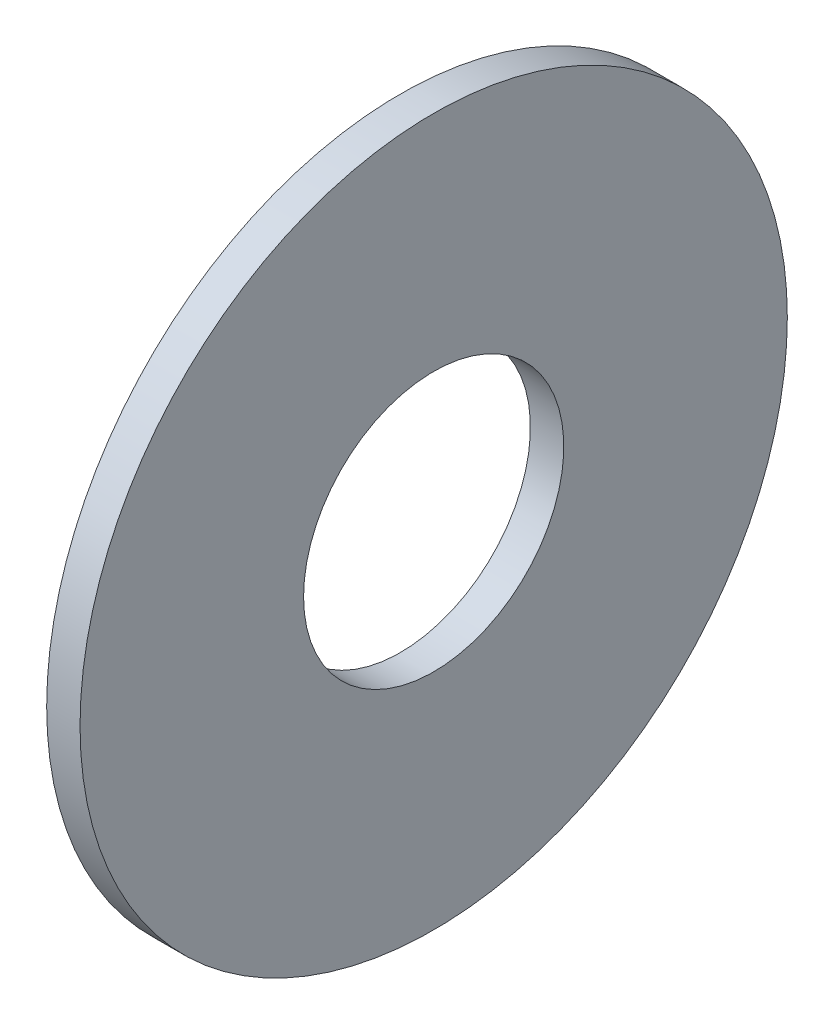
from build123d import *

# Parameters (mm, degrees)
ESQUISSE1_W = 25
ESQUISSE1_H = 167.5


with BuildPart() as part:
    # Esquisse1 → R_volution1 (revolve)
    with BuildSketch(Plane.XY, mode=Mode.PRIVATE) as r_volution1_sk:
        with Locations((12.5, 181.25)):
            Rectangle(ESQUISSE1_W, ESQUISSE1_H)
    revolve(r_volution1_sk.sketch.rotate(Axis((0, 0, 0), (1, 0, 0)), 90), axis=Axis((0, 0, 0), (1, 0, 0)))


solid = part.part
